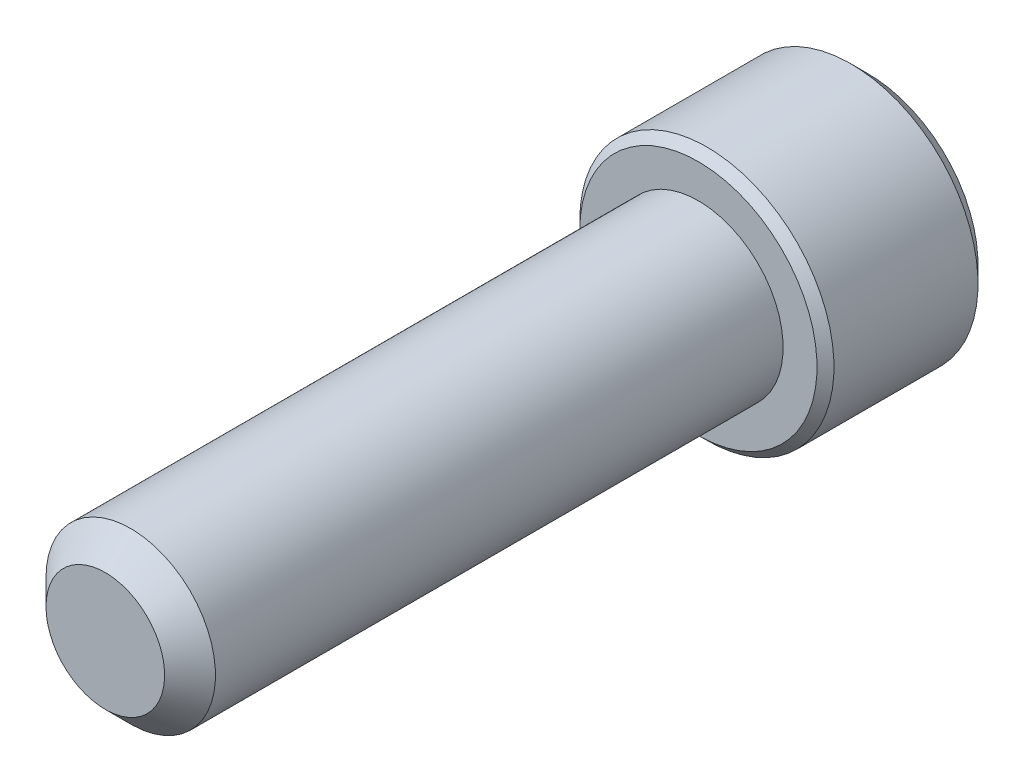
ISO-10303-21;
HEADER;
FILE_DESCRIPTION(('STEP AP214'),'2;1');
FILE_NAME('part.step','',(''),(''),'','','');
FILE_SCHEMA(('AUTOMOTIVE_DESIGN { 1 0 10303 214 1 1 1 1 }'));
ENDSEC;
DATA;
#1=APPLICATION_CONTEXT('core data for automotive mechanical design processes');
#2=APPLICATION_PROTOCOL_DEFINITION('international standard','automotive_design',2000,#1);
#3=PRODUCT_CONTEXT('',#1,'mechanical');
#4=PRODUCT('Part','Part','',(#3));
#5=PRODUCT_RELATED_PRODUCT_CATEGORY('part','',(#4));
#6=PRODUCT_DEFINITION_FORMATION('','',#4);
#7=PRODUCT_DEFINITION_CONTEXT('part definition',#1,'design');
#8=PRODUCT_DEFINITION('design','',#6,#7);
#9=PRODUCT_DEFINITION_SHAPE('','',#8);
#10=(LENGTH_UNIT() NAMED_UNIT(*) SI_UNIT(.MILLI.,.METRE.));
#11=(NAMED_UNIT(*) PLANE_ANGLE_UNIT() SI_UNIT($,.RADIAN.));
#12=(NAMED_UNIT(*) SI_UNIT($,.STERADIAN.) SOLID_ANGLE_UNIT());
#13=UNCERTAINTY_MEASURE_WITH_UNIT(LENGTH_MEASURE(1.E-05),#10,'distance_accuracy_value','');
#14=(GEOMETRIC_REPRESENTATION_CONTEXT(3) GLOBAL_UNCERTAINTY_ASSIGNED_CONTEXT((#13)) GLOBAL_UNIT_ASSIGNED_CONTEXT((#10,
#11,#12)) REPRESENTATION_CONTEXT('',''));
#15=CARTESIAN_POINT('',(0.,0.,0.));
#16=DIRECTION('',(0.,0.,1.));
#17=DIRECTION('',(1.,0.,0.));
#18=AXIS2_PLACEMENT_3D('',#15,#16,#17);
#19=CARTESIAN_POINT('',(0.,0.,-22.225));
#20=DIRECTION('',(0.,0.,1.));
#21=DIRECTION('',(1.,0.,0.));
#22=AXIS2_PLACEMENT_3D('',#19,#20,#21);
#23=CYLINDRICAL_SURFACE('',#22,3.175);
#24=CARTESIAN_POINT('',(0.,0.,-0.952500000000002));
#25=DIRECTION('',(0.,0.,1.));
#26=DIRECTION('',(1.,0.,0.));
#27=AXIS2_PLACEMENT_3D('',#24,#25,#26);
#28=CIRCLE('',#27,3.175);
#29=CARTESIAN_POINT('',(-3.175,0.,-0.952500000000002));
#30=VERTEX_POINT('',#29);
#31=EDGE_CURVE('E111',#30,#30,#28,.F.);
#32=ORIENTED_EDGE('',*,*,#31,.T.);
#33=EDGE_LOOP('',(#32));
#34=FACE_BOUND('',#33,.T.);
#35=CARTESIAN_POINT('',(0.,0.,-22.225));
#36=DIRECTION('',(0.,0.,-1.));
#37=DIRECTION('',(-1.,0.,0.));
#38=AXIS2_PLACEMENT_3D('',#35,#36,#37);
#39=CIRCLE('',#38,3.175);
#40=CARTESIAN_POINT('',(-3.175,0.,-22.225));
#41=VERTEX_POINT('',#40);
#42=EDGE_CURVE('E211',#41,#41,#39,.F.);
#43=ORIENTED_EDGE('',*,*,#42,.T.);
#44=EDGE_LOOP('',(#43));
#45=FACE_BOUND('',#44,.T.);
#46=ADVANCED_FACE('F37',(#34,#45),#23,.T.);
#47=CARTESIAN_POINT('',(0.,0.,0.));
#48=DIRECTION('',(0.,0.,1.));
#49=DIRECTION('',(1.,0.,0.));
#50=AXIS2_PLACEMENT_3D('',#47,#48,#49);
#51=PLANE('',#50);
#52=CARTESIAN_POINT('',(0.,0.,0.));
#53=DIRECTION('',(0.,0.,1.));
#54=DIRECTION('',(1.,0.,0.));
#55=AXIS2_PLACEMENT_3D('',#52,#53,#54);
#56=CIRCLE('',#55,2.2225);
#57=CARTESIAN_POINT('',(-2.2225,0.,0.));
#58=VERTEX_POINT('',#57);
#59=EDGE_CURVE('E210',#58,#58,#56,.T.);
#60=ORIENTED_EDGE('',*,*,#59,.T.);
#61=EDGE_LOOP('',(#60));
#62=FACE_BOUND('',#61,.T.);
#63=ADVANCED_FACE('F188',(#62),#51,.T.);
#64=CARTESIAN_POINT('',(0.,0.,0.));
#65=DIRECTION('',(0.,0.,-1.));
#66=DIRECTION('',(-1.,0.,0.));
#67=AXIS2_PLACEMENT_3D('',#64,#65,#66);
#68=CONICAL_SURFACE('',#67,2.2225,0.785398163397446);
#69=CARTESIAN_POINT('',(-3.175,0.,-0.952500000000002));
#70=CARTESIAN_POINT('',(-3.165078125,0.,-0.942578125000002));
#71=CARTESIAN_POINT('',(-3.15515625,0.,-0.932656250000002));
#72=CARTESIAN_POINT('',(-3.1353125,0.,-0.912812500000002));
#73=CARTESIAN_POINT('',(-3.125390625,0.,-0.902890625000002));
#74=CARTESIAN_POINT('',(-3.105546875,0.,-0.883046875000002));
#75=CARTESIAN_POINT('',(-3.095625,0.,-0.873125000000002));
#76=CARTESIAN_POINT('',(-3.07578125,0.,-0.853281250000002));
#77=CARTESIAN_POINT('',(-3.065859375,0.,-0.843359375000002));
#78=CARTESIAN_POINT('',(-3.046015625,0.,-0.823515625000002));
#79=CARTESIAN_POINT('',(-3.03609375,0.,-0.813593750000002));
#80=CARTESIAN_POINT('',(-3.01625,0.,-0.793750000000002));
#81=CARTESIAN_POINT('',(-3.006328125,0.,-0.783828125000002));
#82=CARTESIAN_POINT('',(-2.986484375,0.,-0.763984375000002));
#83=CARTESIAN_POINT('',(-2.9765625,0.,-0.754062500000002));
#84=CARTESIAN_POINT('',(-2.95671875,0.,-0.734218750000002));
#85=CARTESIAN_POINT('',(-2.946796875,0.,-0.724296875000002));
#86=CARTESIAN_POINT('',(-2.926953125,0.,-0.704453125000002));
#87=CARTESIAN_POINT('',(-2.91703125,0.,-0.694531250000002));
#88=CARTESIAN_POINT('',(-2.8971875,0.,-0.674687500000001));
#89=CARTESIAN_POINT('',(-2.887265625,0.,-0.664765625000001));
#90=CARTESIAN_POINT('',(-2.867421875,0.,-0.644921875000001));
#91=CARTESIAN_POINT('',(-2.8575,0.,-0.635000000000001));
#92=CARTESIAN_POINT('',(-2.83765625,0.,-0.615156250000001));
#93=CARTESIAN_POINT('',(-2.827734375,0.,-0.605234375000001));
#94=CARTESIAN_POINT('',(-2.807890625,0.,-0.585390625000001));
#95=CARTESIAN_POINT('',(-2.79796875,0.,-0.575468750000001));
#96=CARTESIAN_POINT('',(-2.778125,0.,-0.555625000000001));
#97=CARTESIAN_POINT('',(-2.768203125,0.,-0.545703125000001));
#98=CARTESIAN_POINT('',(-2.748359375,0.,-0.525859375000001));
#99=CARTESIAN_POINT('',(-2.7384375,0.,-0.515937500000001));
#100=CARTESIAN_POINT('',(-2.71859375,0.,-0.496093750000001));
#101=CARTESIAN_POINT('',(-2.708671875,0.,-0.486171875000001));
#102=CARTESIAN_POINT('',(-2.688828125,0.,-0.466328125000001));
#103=CARTESIAN_POINT('',(-2.67890625,0.,-0.456406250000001));
#104=CARTESIAN_POINT('',(-2.6590625,0.,-0.436562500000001));
#105=CARTESIAN_POINT('',(-2.649140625,0.,-0.426640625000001));
#106=CARTESIAN_POINT('',(-2.629296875,0.,-0.406796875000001));
#107=CARTESIAN_POINT('',(-2.619375,0.,-0.396875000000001));
#108=CARTESIAN_POINT('',(-2.59953125,0.,-0.377031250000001));
#109=CARTESIAN_POINT('',(-2.589609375,0.,-0.367109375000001));
#110=CARTESIAN_POINT('',(-2.569765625,0.,-0.347265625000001));
#111=CARTESIAN_POINT('',(-2.55984375,0.,-0.337343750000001));
#112=CARTESIAN_POINT('',(-2.54,0.,-0.317500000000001));
#113=CARTESIAN_POINT('',(-2.530078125,0.,-0.307578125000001));
#114=CARTESIAN_POINT('',(-2.510234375,0.,-0.287734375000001));
#115=CARTESIAN_POINT('',(-2.5003125,0.,-0.277812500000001));
#116=CARTESIAN_POINT('',(-2.48046875,0.,-0.257968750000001));
#117=CARTESIAN_POINT('',(-2.470546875,0.,-0.248046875));
#118=CARTESIAN_POINT('',(-2.450703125,0.,-0.228203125));
#119=CARTESIAN_POINT('',(-2.44078125,0.,-0.21828125));
#120=CARTESIAN_POINT('',(-2.4209375,0.,-0.1984375));
#121=CARTESIAN_POINT('',(-2.411015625,0.,-0.188515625));
#122=CARTESIAN_POINT('',(-2.391171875,0.,-0.168671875));
#123=CARTESIAN_POINT('',(-2.38125,0.,-0.15875));
#124=CARTESIAN_POINT('',(-2.36140625,0.,-0.13890625));
#125=CARTESIAN_POINT('',(-2.351484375,0.,-0.128984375));
#126=CARTESIAN_POINT('',(-2.331640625,0.,-0.109140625));
#127=CARTESIAN_POINT('',(-2.32171875,0.,-0.0992187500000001));
#128=CARTESIAN_POINT('',(-2.301875,0.,-0.0793750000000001));
#129=CARTESIAN_POINT('',(-2.291953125,0.,-0.0694531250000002));
#130=CARTESIAN_POINT('',(-2.272109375,0.,-0.0496093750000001));
#131=CARTESIAN_POINT('',(-2.2621875,0.,-0.0396875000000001));
#132=CARTESIAN_POINT('',(-2.24234375,0.,-0.01984375));
#133=CARTESIAN_POINT('',(-2.232421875,0.,-0.00992187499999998));
#134=CARTESIAN_POINT('',(-2.2225,0.,0.));
#135=B_SPLINE_CURVE_WITH_KNOTS('',3,(#69,#70,#71,#72,#73,#74,#75,#76,#77,#78,#79,#80,#81,#82,
#83,#84,#85,#86,#87,#88,#89,#90,#91,#92,#93,#94,#95,#96,#97,#98,#99,#100,#101,#102,#103,#104,
#105,#106,#107,#108,#109,#110,#111,#112,#113,#114,#115,#116,#117,#118,#119,#120,#121,#122,#123,
#124,#125,#126,#127,#128,#129,#130,#131,#132,#133,#134),.UNSPECIFIED.,.F.,.F.,(4,2,2,2,2,2,2,2,
2,2,2,2,2,2,2,2,2,2,2,2,2,2,2,2,2,2,2,2,2,2,2,2,4),(0.,0.0420949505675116,0.0841899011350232,
0.126284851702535,0.168379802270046,0.210474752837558,0.25256970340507,0.294664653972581,
0.336759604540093,0.378854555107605,0.420949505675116,0.463044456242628,0.50513940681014,
0.547234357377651,0.589329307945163,0.631424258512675,0.673519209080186,0.715614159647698,
0.75770911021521,0.799804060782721,0.841899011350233,0.883993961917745,0.926088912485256,
0.968183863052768,1.01027881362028,1.05237376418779,1.0944687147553,1.13656366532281,
1.17865861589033,1.22075356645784,1.26284851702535,1.30494346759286,1.34703841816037),.UNSPECIFIED.);
#136=EDGE_CURVE('BSEAM194',#30,#58,#135,.T.);
#137=ORIENTED_EDGE('',*,*,#31,.F.);
#138=ORIENTED_EDGE('',*,*,#59,.F.);
#139=ORIENTED_EDGE('',*,*,#136,.T.);
#140=ORIENTED_EDGE('',*,*,#136,.F.);
#141=EDGE_LOOP('',(#137,#139,#138,#140));
#142=FACE_BOUND('',#141,.T.);
#143=ADVANCED_FACE('F194',(#142),#68,.T.);
#144=CARTESIAN_POINT('',(0.,0.,-28.575));
#145=DIRECTION('',(0.,0.,1.));
#146=DIRECTION('',(1.,0.,0.));
#147=AXIS2_PLACEMENT_3D('',#144,#145,#146);
#148=CYLINDRICAL_SURFACE('',#147,4.7625);
#149=CARTESIAN_POINT('',(0.,0.,-22.5425));
#150=DIRECTION('',(0.,0.,-1.));
#151=DIRECTION('',(-1.,0.,0.));
#152=AXIS2_PLACEMENT_3D('',#149,#150,#151);
#153=CIRCLE('',#152,4.7625);
#154=CARTESIAN_POINT('',(-4.7625,0.,-22.5425));
#155=VERTEX_POINT('',#154);
#156=EDGE_CURVE('E45',#155,#155,#153,.T.);
#157=ORIENTED_EDGE('',*,*,#156,.T.);
#158=EDGE_LOOP('',(#157));
#159=FACE_BOUND('',#158,.T.);
#160=CARTESIAN_POINT('',(0.,0.,-27.94));
#161=DIRECTION('',(0.,0.,-1.));
#162=DIRECTION('',(-1.,0.,0.));
#163=AXIS2_PLACEMENT_3D('',#160,#161,#162);
#164=CIRCLE('',#163,4.7625);
#165=CARTESIAN_POINT('',(-4.7625,0.,-27.94));
#166=VERTEX_POINT('',#165);
#167=EDGE_CURVE('E171',#166,#166,#164,.F.);
#168=ORIENTED_EDGE('',*,*,#167,.T.);
#169=EDGE_LOOP('',(#168));
#170=FACE_BOUND('',#169,.T.);
#171=ADVANCED_FACE('F176',(#159,#170),#148,.T.);
#172=CARTESIAN_POINT('',(0.,0.,-28.575));
#173=DIRECTION('',(0.,0.,-1.));
#174=DIRECTION('',(-1.,0.,0.));
#175=AXIS2_PLACEMENT_3D('',#172,#173,#174);
#176=PLANE('',#175);
#177=CARTESIAN_POINT('',(0.,0.,-28.575));
#178=DIRECTION('',(0.,0.,-1.));
#179=DIRECTION('',(-1.,0.,0.));
#180=AXIS2_PLACEMENT_3D('',#177,#178,#179);
#181=CIRCLE('',#180,4.1275);
#182=CARTESIAN_POINT('',(-4.1275,0.,-28.575));
#183=VERTEX_POINT('',#182);
#184=EDGE_CURVE('E110',#183,#183,#181,.T.);
#185=ORIENTED_EDGE('',*,*,#184,.T.);
#186=EDGE_LOOP('',(#185));
#187=FACE_BOUND('',#186,.T.);
#188=CARTESIAN_POINT('',(0.,0.,-28.575));
#189=DIRECTION('',(0.,0.,-1.));
#190=DIRECTION('',(-1.,0.,0.));
#191=AXIS2_PLACEMENT_3D('',#188,#189,#190);
#192=CIRCLE('',#191,2.74963065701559);
#193=CARTESIAN_POINT('',(-2.38125,1.3748153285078,-28.575));
#194=VERTEX_POINT('',#193);
#195=CARTESIAN_POINT('',(0.,2.74963065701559,-28.575));
#196=VERTEX_POINT('',#195);
#197=EDGE_CURVE('E91',#194,#196,#192,.T.);
#198=ORIENTED_EDGE('',*,*,#197,.F.);
#199=CARTESIAN_POINT('',(-2.38125,-1.3748153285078,-28.575));
#200=VERTEX_POINT('',#199);
#201=EDGE_CURVE('E51',#200,#194,#192,.T.);
#202=ORIENTED_EDGE('',*,*,#201,.F.);
#203=CARTESIAN_POINT('',(0.,-2.74963065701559,-28.575));
#204=VERTEX_POINT('',#203);
#205=EDGE_CURVE('E267',#204,#200,#192,.T.);
#206=ORIENTED_EDGE('',*,*,#205,.F.);
#207=CARTESIAN_POINT('',(2.38125,-1.3748153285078,-28.575));
#208=VERTEX_POINT('',#207);
#209=EDGE_CURVE('E58',#208,#204,#192,.T.);
#210=ORIENTED_EDGE('',*,*,#209,.F.);
#211=CARTESIAN_POINT('',(2.38125,1.3748153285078,-28.575));
#212=VERTEX_POINT('',#211);
#213=EDGE_CURVE('E132',#212,#208,#192,.T.);
#214=ORIENTED_EDGE('',*,*,#213,.F.);
#215=EDGE_CURVE('E100',#196,#212,#192,.T.);
#216=ORIENTED_EDGE('',*,*,#215,.F.);
#217=EDGE_LOOP('',(#198,#202,#206,#210,#214,#216));
#218=FACE_BOUND('',#217,.T.);
#219=ADVANCED_FACE('F131',(#187,#218),#176,.T.);
#220=CARTESIAN_POINT('',(0.,0.,-22.225));
#221=DIRECTION('',(0.,0.,-1.));
#222=DIRECTION('',(-1.,0.,0.));
#223=AXIS2_PLACEMENT_3D('',#220,#221,#222);
#224=PLANE('',#223);
#225=CARTESIAN_POINT('',(0.,0.,-22.225));
#226=DIRECTION('',(0.,0.,-1.));
#227=DIRECTION('',(-1.,0.,0.));
#228=AXIS2_PLACEMENT_3D('',#225,#226,#227);
#229=CIRCLE('',#228,4.445);
#230=CARTESIAN_POINT('',(-4.445,0.,-22.225));
#231=VERTEX_POINT('',#230);
#232=EDGE_CURVE('E12',#231,#231,#229,.F.);
#233=ORIENTED_EDGE('',*,*,#232,.T.);
#234=EDGE_LOOP('',(#233));
#235=FACE_BOUND('',#234,.T.);
#236=ORIENTED_EDGE('',*,*,#42,.F.);
#237=EDGE_LOOP('',(#236));
#238=FACE_BOUND('',#237,.T.);
#239=ADVANCED_FACE('F279',(#235,#238),#224,.F.);
#240=CARTESIAN_POINT('',(0.,0.,-28.575));
#241=DIRECTION('',(0.,0.,-1.));
#242=DIRECTION('',(-1.,0.,0.));
#243=AXIS2_PLACEMENT_3D('',#240,#241,#242);
#244=CONICAL_SURFACE('',#243,2.74963065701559,0.78539816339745);
#245=ORIENTED_EDGE('',*,*,#215,.T.);
#246=CARTESIAN_POINT('',(-0.000199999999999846,2.74974612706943,-28.5751154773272));
#247=CARTESIAN_POINT('',(0.0816567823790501,2.70248609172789,-28.5278948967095));
#248=CARTESIAN_POINT('',(0.16488233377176,2.65443579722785,-28.4834475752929));
#249=CARTESIAN_POINT('',(0.334588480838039,2.556455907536,-28.4020654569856));
#250=CARTESIAN_POINT('',(0.421085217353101,2.50651699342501,-28.3651759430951));
#251=CARTESIAN_POINT('',(0.59550177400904,2.40581754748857,-28.3019834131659));
#252=CARTESIAN_POINT('',(0.683377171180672,2.35508266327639,-28.2755215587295));
#253=CARTESIAN_POINT('',(0.861062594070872,2.25249593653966,-28.2347515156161));
#254=CARTESIAN_POINT('',(0.950867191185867,2.20064722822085,-28.2204128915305));
#255=CARTESIAN_POINT('',(1.10563960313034,2.11128933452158,-28.2074757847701));
#256=CARTESIAN_POINT('',(1.17040744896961,2.07389560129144,-28.2055606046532));
#257=CARTESIAN_POINT('',(1.29983727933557,1.99916925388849,-28.2087866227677));
#258=CARTESIAN_POINT('',(1.36449921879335,1.96183666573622,-28.2139302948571));
#259=CARTESIAN_POINT('',(1.49321254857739,1.88752399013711,-28.2309813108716));
#260=CARTESIAN_POINT('',(1.55726317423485,1.85054434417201,-28.2428962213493));
#261=CARTESIAN_POINT('',(1.68425683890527,1.77722451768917,-28.272835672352));
#262=CARTESIAN_POINT('',(1.74719996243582,1.74088428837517,-28.2908597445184));
#263=CARTESIAN_POINT('',(1.90842615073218,1.64780030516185,-28.3443688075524));
#264=CARTESIAN_POINT('',(2.00570949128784,1.59163374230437,-28.3838874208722));
#265=CARTESIAN_POINT('',(2.14875606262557,1.50904576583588,-28.4506003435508));
#266=CARTESIAN_POINT('',(2.19589628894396,1.4818293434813,-28.4740402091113));
#267=CARTESIAN_POINT('',(2.28930352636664,1.42790064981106,-28.5230566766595));
#268=CARTESIAN_POINT('',(2.33557105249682,1.40118808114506,-28.5486319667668));
#269=CARTESIAN_POINT('',(2.38145,1.37469985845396,-28.5751154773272));
#270=B_SPLINE_CURVE_WITH_KNOTS('',3,(#246,#247,#248,#249,#250,#251,#252,#253,#254,#255,#256,
#257,#258,#259,#260,#261,#262,#263,#264,#265,#266,#267,#268,#269),.UNSPECIFIED.,.F.,.F.,(4,2,2,
2,2,2,2,2,2,2,2,4),(0.,0.317196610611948,0.636241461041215,0.950218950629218,1.26340583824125,
1.48752413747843,1.71172100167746,1.93616888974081,2.16059957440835,2.51709639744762,
2.69486147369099,2.87251813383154),.UNSPECIFIED.);
#271=EDGE_CURVE('E105',#196,#212,#270,.T.);
#272=ORIENTED_EDGE('',*,*,#271,.F.);
#273=EDGE_LOOP('',(#245,#272));
#274=FACE_BOUND('',#273,.T.);
#275=ADVANCED_FACE('F106',(#274),#244,.F.);
#276=ORIENTED_EDGE('',*,*,#213,.T.);
#277=CARTESIAN_POINT('',(2.38125,-2.76261914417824,-29.4726170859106));
#278=CARTESIAN_POINT('',(2.38125,-2.69544479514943,-29.4217472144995));
#279=CARTESIAN_POINT('',(2.38125,-2.62789666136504,-29.371362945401));
#280=CARTESIAN_POINT('',(2.38125,-2.49190448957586,-29.2717837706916));
#281=CARTESIAN_POINT('',(2.38125,-2.42346023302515,-29.2225891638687));
#282=CARTESIAN_POINT('',(2.38125,-2.28502676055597,-29.1252575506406));
#283=CARTESIAN_POINT('',(2.38125,-2.21502968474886,-29.0771316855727));
#284=CARTESIAN_POINT('',(2.38125,-2.07385103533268,-28.9826556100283));
#285=CARTESIAN_POINT('',(2.38125,-2.00266954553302,-28.936305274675));
#286=CARTESIAN_POINT('',(2.38125,-1.85474026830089,-28.8431368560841));
#287=CARTESIAN_POINT('',(2.38125,-1.7779099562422,-28.7964491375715));
#288=CARTESIAN_POINT('',(2.38125,-1.62247617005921,-28.7061296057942));
#289=CARTESIAN_POINT('',(2.38125,-1.5438729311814,-28.6624973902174));
#290=CARTESIAN_POINT('',(2.38125,-1.38486272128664,-28.5792071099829));
#291=CARTESIAN_POINT('',(2.38125,-1.30446163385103,-28.5395379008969));
#292=CARTESIAN_POINT('',(2.38125,-1.14145314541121,-28.4650690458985));
#293=CARTESIAN_POINT('',(2.38125,-1.05884677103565,-28.4302671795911));
#294=CARTESIAN_POINT('',(2.38125,-0.89829608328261,-28.3694298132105));
#295=CARTESIAN_POINT('',(2.38125,-0.820539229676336,-28.3429047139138));
#296=CARTESIAN_POINT('',(2.38125,-0.663135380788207,-28.29608983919));
#297=CARTESIAN_POINT('',(2.38125,-0.583488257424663,-28.2758004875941));
#298=CARTESIAN_POINT('',(2.38125,-0.424114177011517,-28.2428604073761));
#299=CARTESIAN_POINT('',(2.38125,-0.344414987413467,-28.2300775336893));
#300=CARTESIAN_POINT('',(2.38125,-0.184141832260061,-28.2124018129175));
#301=CARTESIAN_POINT('',(2.38125,-0.103568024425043,-28.2075075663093));
#302=CARTESIAN_POINT('',(2.38125,0.0546452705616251,-28.2059814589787));
#303=CARTESIAN_POINT('',(2.38125,0.132281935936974,-28.2090477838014));
#304=CARTESIAN_POINT('',(2.38125,0.286899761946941,-28.2226029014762));
#305=CARTESIAN_POINT('',(2.38125,0.363880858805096,-28.2330924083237));
#306=CARTESIAN_POINT('',(2.38125,0.517934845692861,-28.2610957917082));
#307=CARTESIAN_POINT('',(2.38125,0.594985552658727,-28.2787299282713));
#308=CARTESIAN_POINT('',(2.38125,0.747397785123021,-28.3200790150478));
#309=CARTESIAN_POINT('',(2.38125,0.822759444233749,-28.3437934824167));
#310=CARTESIAN_POINT('',(2.38125,1.05910849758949,-28.4271079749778));
#311=CARTESIAN_POINT('',(2.38125,1.21677702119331,-28.4961581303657));
#312=CARTESIAN_POINT('',(2.38125,1.44750538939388,-28.6112600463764));
#313=CARTESIAN_POINT('',(2.38125,1.52359597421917,-28.6516390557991));
#314=CARTESIAN_POINT('',(2.38125,1.67404919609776,-28.7355045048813));
#315=CARTESIAN_POINT('',(2.38125,1.74841214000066,-28.7789903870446));
#316=CARTESIAN_POINT('',(2.38125,1.89195740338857,-28.8662197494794));
#317=CARTESIAN_POINT('',(2.38125,1.96121356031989,-28.9098431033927));
#318=CARTESIAN_POINT('',(2.38125,2.09853826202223,-28.9989297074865));
#319=CARTESIAN_POINT('',(2.38125,2.1666067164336,-29.0443930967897));
#320=CARTESIAN_POINT('',(2.38125,2.30115854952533,-29.1364552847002));
#321=CARTESIAN_POINT('',(2.38125,2.36765030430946,-29.1830418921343));
#322=CARTESIAN_POINT('',(2.38125,2.4997244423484,-29.2774503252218));
#323=CARTESIAN_POINT('',(2.38125,2.56530707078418,-29.3252718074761));
#324=CARTESIAN_POINT('',(2.38125,2.63050907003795,-29.3735984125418));
#325=B_SPLINE_CURVE_WITH_KNOTS('',3,(#277,#278,#279,#280,#281,#282,#283,#284,#285,#286,#287,
#288,#289,#290,#291,#292,#293,#294,#295,#296,#297,#298,#299,#300,#301,#302,#303,#304,#305,#306,
#307,#308,#309,#310,#311,#312,#313,#314,#315,#316,#317,#318,#319,#320,#321,#322,#323,#324),
.UNSPECIFIED.,.F.,.F.,(4,2,2,2,2,2,2,2,2,2,2,2,2,2,2,2,2,2,2,2,2,2,2,4),(0.,0.252791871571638,
0.505646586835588,0.760459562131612,1.01525458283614,1.28490904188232,1.55452792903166,
1.82336591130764,2.09208085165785,2.33833488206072,2.58460564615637,2.82639989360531,
3.06815123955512,3.30087188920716,3.53361492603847,3.7704500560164,4.00726638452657,
4.52203846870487,4.78044014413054,5.03879556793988,5.28431582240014,5.52985467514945,
5.77340315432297,6.01688462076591),.UNSPECIFIED.);
#326=EDGE_CURVE('E99',#212,#208,#325,.F.);
#327=ORIENTED_EDGE('',*,*,#326,.F.);
#328=EDGE_LOOP('',(#276,#327));
#329=FACE_BOUND('',#328,.T.);
#330=ADVANCED_FACE('F273',(#329),#244,.F.);
#331=ORIENTED_EDGE('',*,*,#209,.T.);
#332=CARTESIAN_POINT('',(2.38145,-1.37469985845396,-28.5751154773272));
#333=CARTESIAN_POINT('',(2.29959321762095,-1.4219598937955,-28.5278948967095));
#334=CARTESIAN_POINT('',(2.21636766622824,-1.47001018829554,-28.4834475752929));
#335=CARTESIAN_POINT('',(2.04666151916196,-1.56799007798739,-28.4020654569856));
#336=CARTESIAN_POINT('',(1.9601647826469,-1.61792899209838,-28.3651759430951));
#337=CARTESIAN_POINT('',(1.78574822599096,-1.71862843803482,-28.3019834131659));
#338=CARTESIAN_POINT('',(1.69787282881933,-1.769363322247,-28.2755215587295));
#339=CARTESIAN_POINT('',(1.52018740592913,-1.87195004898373,-28.2347515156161));
#340=CARTESIAN_POINT('',(1.43038280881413,-1.92379875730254,-28.2204128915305));
#341=CARTESIAN_POINT('',(1.27561039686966,-2.01315665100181,-28.2074757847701));
#342=CARTESIAN_POINT('',(1.21084255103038,-2.05055038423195,-28.2055606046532));
#343=CARTESIAN_POINT('',(1.08141272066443,-2.1252767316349,-28.2087866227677));
#344=CARTESIAN_POINT('',(1.01675078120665,-2.16260931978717,-28.2139302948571));
#345=CARTESIAN_POINT('',(0.888037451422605,-2.23692199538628,-28.2309813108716));
#346=CARTESIAN_POINT('',(0.823986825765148,-2.27390164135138,-28.2428962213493));
#347=CARTESIAN_POINT('',(0.696993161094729,-2.34722146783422,-28.272835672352));
#348=CARTESIAN_POINT('',(0.634050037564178,-2.38356169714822,-28.2908597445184));
#349=CARTESIAN_POINT('',(0.472823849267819,-2.47664568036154,-28.3443688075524));
#350=CARTESIAN_POINT('',(0.37554050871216,-2.53281224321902,-28.3838874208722));
#351=CARTESIAN_POINT('',(0.23249393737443,-2.61540021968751,-28.4506003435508));
#352=CARTESIAN_POINT('',(0.185353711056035,-2.6426166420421,-28.4740402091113));
#353=CARTESIAN_POINT('',(0.091946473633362,-2.69654533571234,-28.5230566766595));
#354=CARTESIAN_POINT('',(0.0456789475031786,-2.72325790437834,-28.5486319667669));
#355=CARTESIAN_POINT('',(-0.000200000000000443,-2.74974612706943,-28.5751154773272));
#356=B_SPLINE_CURVE_WITH_KNOTS('',3,(#332,#333,#334,#335,#336,#337,#338,#339,#340,#341,#342,
#343,#344,#345,#346,#347,#348,#349,#350,#351,#352,#353,#354,#355),.UNSPECIFIED.,.F.,.F.,(4,2,2,
2,2,2,2,2,2,2,2,4),(0.,0.31719661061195,0.636241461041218,0.950218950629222,1.26340583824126,
1.48752413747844,1.71172100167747,1.93616888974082,2.16059957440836,2.51709639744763,
2.69486147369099,2.87251813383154),.UNSPECIFIED.);
#357=EDGE_CURVE('E141',#208,#204,#356,.T.);
#358=ORIENTED_EDGE('',*,*,#357,.F.);
#359=EDGE_LOOP('',(#331,#358));
#360=FACE_BOUND('',#359,.T.);
#361=ADVANCED_FACE('F270',(#360),#244,.F.);
#362=ORIENTED_EDGE('',*,*,#205,.T.);
#363=CARTESIAN_POINT('',(0.000200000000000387,-2.74974612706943,-28.5751154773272));
#364=CARTESIAN_POINT('',(-0.0816567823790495,-2.70248609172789,-28.5278948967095));
#365=CARTESIAN_POINT('',(-0.16488233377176,-2.65443579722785,-28.4834475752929));
#366=CARTESIAN_POINT('',(-0.33458848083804,-2.556455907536,-28.4020654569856));
#367=CARTESIAN_POINT('',(-0.421085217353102,-2.50651699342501,-28.3651759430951));
#368=CARTESIAN_POINT('',(-0.595501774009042,-2.40581754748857,-28.3019834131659));
#369=CARTESIAN_POINT('',(-0.683377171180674,-2.35508266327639,-28.2755215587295));
#370=CARTESIAN_POINT('',(-0.861062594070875,-2.25249593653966,-28.2347515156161));
#371=CARTESIAN_POINT('',(-0.950867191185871,-2.20064722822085,-28.2204128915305));
#372=CARTESIAN_POINT('',(-1.10563960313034,-2.11128933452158,-28.2074757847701));
#373=CARTESIAN_POINT('',(-1.17040744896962,-2.07389560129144,-28.2055606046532));
#374=CARTESIAN_POINT('',(-1.29983727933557,-1.99916925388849,-28.2087866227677));
#375=CARTESIAN_POINT('',(-1.36449921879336,-1.96183666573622,-28.2139302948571));
#376=CARTESIAN_POINT('',(-1.4932125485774,-1.88752399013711,-28.2309813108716));
#377=CARTESIAN_POINT('',(-1.55726317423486,-1.85054434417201,-28.2428962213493));
#378=CARTESIAN_POINT('',(-1.68425683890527,-1.77722451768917,-28.272835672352));
#379=CARTESIAN_POINT('',(-1.74719996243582,-1.74088428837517,-28.2908597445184));
#380=CARTESIAN_POINT('',(-1.90842615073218,-1.64780030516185,-28.3443688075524));
#381=CARTESIAN_POINT('',(-2.00570949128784,-1.59163374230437,-28.3838874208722));
#382=CARTESIAN_POINT('',(-2.14875606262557,-1.50904576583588,-28.4506003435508));
#383=CARTESIAN_POINT('',(-2.19589628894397,-1.48182934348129,-28.4740402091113));
#384=CARTESIAN_POINT('',(-2.28930352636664,-1.42790064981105,-28.5230566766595));
#385=CARTESIAN_POINT('',(-2.33557105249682,-1.40118808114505,-28.5486319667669));
#386=CARTESIAN_POINT('',(-2.38145,-1.37469985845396,-28.5751154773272));
#387=B_SPLINE_CURVE_WITH_KNOTS('',3,(#363,#364,#365,#366,#367,#368,#369,#370,#371,#372,#373,
#374,#375,#376,#377,#378,#379,#380,#381,#382,#383,#384,#385,#386),.UNSPECIFIED.,.F.,.F.,(4,2,2,
2,2,2,2,2,2,2,2,4),(0.,0.317196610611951,0.636241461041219,0.950218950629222,1.26340583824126,
1.48752413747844,1.71172100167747,1.93616888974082,2.16059957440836,2.51709639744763,
2.69486147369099,2.87251813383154),.UNSPECIFIED.);
#388=EDGE_CURVE('E245',#204,#200,#387,.T.);
#389=ORIENTED_EDGE('',*,*,#388,.F.);
#390=EDGE_LOOP('',(#362,#389));
#391=FACE_BOUND('',#390,.T.);
#392=ADVANCED_FACE('F269',(#391),#244,.F.);
#393=ORIENTED_EDGE('',*,*,#201,.T.);
#394=CARTESIAN_POINT('',(-2.38125,-2.76261914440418,-29.4726170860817));
#395=CARTESIAN_POINT('',(-2.38125,-2.69544479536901,-29.4217472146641));
#396=CARTESIAN_POINT('',(-2.38125,-2.62789666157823,-29.3713629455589));
#397=CARTESIAN_POINT('',(-2.38125,-2.4919044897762,-29.2717837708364));
#398=CARTESIAN_POINT('',(-2.38125,-2.42346023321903,-29.2225891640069));
#399=CARTESIAN_POINT('',(-2.38125,-2.28502676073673,-29.1252575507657));
#400=CARTESIAN_POINT('',(-2.38125,-2.21502968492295,-29.0771316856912));
#401=CARTESIAN_POINT('',(-2.38125,-2.0738510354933,-28.9826556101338));
#402=CARTESIAN_POINT('',(-2.38125,-2.00266954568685,-28.9363052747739));
#403=CARTESIAN_POINT('',(-2.38125,-1.85474026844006,-28.8431368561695));
#404=CARTESIAN_POINT('',(-2.38125,-1.77790995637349,-28.7964491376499));
#405=CARTESIAN_POINT('',(-2.38125,-1.62247617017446,-28.706129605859));
#406=CARTESIAN_POINT('',(-2.38125,-1.54387293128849,-28.6624973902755));
#407=CARTESIAN_POINT('',(-2.38125,-1.38486272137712,-28.5792071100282));
#408=CARTESIAN_POINT('',(-2.38125,-1.30446163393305,-28.5395379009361));
#409=CARTESIAN_POINT('',(-2.38125,-1.14145314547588,-28.4650690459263));
#410=CARTESIAN_POINT('',(-2.38125,-1.05884677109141,-28.4302671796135));
#411=CARTESIAN_POINT('',(-2.38125,-0.898296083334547,-28.369429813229));
#412=CARTESIAN_POINT('',(-2.38125,-0.820539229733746,-28.3429047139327));
#413=CARTESIAN_POINT('',(-2.38125,-0.663135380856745,-28.2960898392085));
#414=CARTESIAN_POINT('',(-2.38125,-0.583488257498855,-28.2758004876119));
#415=CARTESIAN_POINT('',(-2.38125,-0.424114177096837,-28.2428604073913));
#416=CARTESIAN_POINT('',(-2.38125,-0.344414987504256,-28.2300775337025));
#417=CARTESIAN_POINT('',(-2.38125,-0.184141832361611,-28.2124018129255));
#418=CARTESIAN_POINT('',(-2.38125,-0.103568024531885,-28.2075075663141));
#419=CARTESIAN_POINT('',(-2.38125,0.0546452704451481,-28.2059814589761));
#420=CARTESIAN_POINT('',(-2.38125,0.132281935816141,-28.2090477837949));
#421=CARTESIAN_POINT('',(-2.38125,0.286899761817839,-28.2226029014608));
#422=CARTESIAN_POINT('',(-2.38125,0.363880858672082,-28.2330924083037));
#423=CARTESIAN_POINT('',(-2.38125,0.517934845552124,-28.2610957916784));
#424=CARTESIAN_POINT('',(-2.38125,0.594985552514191,-28.2787299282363));
#425=CARTESIAN_POINT('',(-2.38125,0.747397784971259,-28.3200790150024));
#426=CARTESIAN_POINT('',(-2.38125,0.82275944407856,-28.3437934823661));
#427=CARTESIAN_POINT('',(-2.38125,1.05910849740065,-28.4271079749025));
#428=CARTESIAN_POINT('',(-2.38125,1.21677702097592,-28.4961581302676));
#429=CARTESIAN_POINT('',(-2.38125,1.44750538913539,-28.6112600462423));
#430=CARTESIAN_POINT('',(-2.38125,1.52359597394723,-28.6516390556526));
#431=CARTESIAN_POINT('',(-2.38125,1.67404919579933,-28.7355045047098));
#432=CARTESIAN_POINT('',(-2.38125,1.7484121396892,-28.7789903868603));
#433=CARTESIAN_POINT('',(-2.38125,1.89195740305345,-28.866219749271));
#434=CARTESIAN_POINT('',(-2.38125,1.96121355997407,-28.9098431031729));
#435=CARTESIAN_POINT('',(-2.38125,2.09853826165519,-28.9989297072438));
#436=CARTESIAN_POINT('',(-2.38125,2.16660671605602,-29.0443930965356));
#437=CARTESIAN_POINT('',(-2.38125,2.30115854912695,-29.1364552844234));
#438=CARTESIAN_POINT('',(-2.38125,2.36765030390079,-29.1830418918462));
#439=CARTESIAN_POINT('',(-2.38125,2.49972444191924,-29.2774503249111));
#440=CARTESIAN_POINT('',(-2.38125,2.5653070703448,-29.3252718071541));
#441=CARTESIAN_POINT('',(-2.38125,2.63050906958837,-29.3735984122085));
#442=B_SPLINE_CURVE_WITH_KNOTS('',3,(#394,#395,#396,#397,#398,#399,#400,#401,#402,#403,#404,
#405,#406,#407,#408,#409,#410,#411,#412,#413,#414,#415,#416,#417,#418,#419,#420,#421,#422,#423,
#424,#425,#426,#427,#428,#429,#430,#431,#432,#433,#434,#435,#436,#437,#438,#439,#440,#441),
.UNSPECIFIED.,.F.,.F.,(4,2,2,2,2,2,2,2,2,2,2,2,2,2,2,2,2,2,2,2,2,2,2,4),(0.,0.252791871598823,
0.505646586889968,0.760459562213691,1.01525458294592,1.2849090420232,1.55452792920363,
1.82336591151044,2.09208085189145,2.33833488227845,2.58460564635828,2.82639989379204,
3.06815123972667,3.30087188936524,3.53361492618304,3.77045005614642,4.00726638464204,
4.52203846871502,4.78044014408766,5.03879556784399,5.28431582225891,5.52985467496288,
5.77340315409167,6.01688462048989),.UNSPECIFIED.);
#443=EDGE_CURVE('E121',#200,#194,#442,.T.);
#444=ORIENTED_EDGE('',*,*,#443,.F.);
#445=EDGE_LOOP('',(#393,#444));
#446=FACE_BOUND('',#445,.T.);
#447=ADVANCED_FACE('F286',(#446),#244,.F.);
#448=ORIENTED_EDGE('',*,*,#197,.T.);
#449=CARTESIAN_POINT('',(-2.38145,1.37469985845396,-28.5751154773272));
#450=CARTESIAN_POINT('',(-2.29959321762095,1.4219598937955,-28.5278948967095));
#451=CARTESIAN_POINT('',(-2.21636766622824,1.47001018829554,-28.4834475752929));
#452=CARTESIAN_POINT('',(-2.04666151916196,1.56799007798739,-28.4020654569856));
#453=CARTESIAN_POINT('',(-1.9601647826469,1.61792899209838,-28.3651759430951));
#454=CARTESIAN_POINT('',(-1.78574822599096,1.71862843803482,-28.3019834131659));
#455=CARTESIAN_POINT('',(-1.69787282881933,1.769363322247,-28.2755215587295));
#456=CARTESIAN_POINT('',(-1.52018740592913,1.87195004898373,-28.2347515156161));
#457=CARTESIAN_POINT('',(-1.43038280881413,1.92379875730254,-28.2204128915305));
#458=CARTESIAN_POINT('',(-1.27561039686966,2.01315665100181,-28.2074757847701));
#459=CARTESIAN_POINT('',(-1.21084255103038,2.05055038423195,-28.2055606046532));
#460=CARTESIAN_POINT('',(-1.08141272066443,2.1252767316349,-28.2087866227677));
#461=CARTESIAN_POINT('',(-1.01675078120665,2.16260931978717,-28.2139302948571));
#462=CARTESIAN_POINT('',(-0.888037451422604,2.23692199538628,-28.2309813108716));
#463=CARTESIAN_POINT('',(-0.823986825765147,2.27390164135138,-28.2428962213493));
#464=CARTESIAN_POINT('',(-0.696993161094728,2.34722146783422,-28.272835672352));
#465=CARTESIAN_POINT('',(-0.634050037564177,2.38356169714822,-28.2908597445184));
#466=CARTESIAN_POINT('',(-0.472823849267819,2.47664568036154,-28.3443688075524));
#467=CARTESIAN_POINT('',(-0.375540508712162,2.53281224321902,-28.3838874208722));
#468=CARTESIAN_POINT('',(-0.232493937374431,2.61540021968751,-28.4506003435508));
#469=CARTESIAN_POINT('',(-0.185353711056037,2.64261664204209,-28.4740402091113));
#470=CARTESIAN_POINT('',(-0.0919464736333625,2.69654533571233,-28.5230566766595));
#471=CARTESIAN_POINT('',(-0.0456789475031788,2.72325790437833,-28.5486319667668));
#472=CARTESIAN_POINT('',(0.000199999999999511,2.74974612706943,-28.5751154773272));
#473=B_SPLINE_CURVE_WITH_KNOTS('',3,(#449,#450,#451,#452,#453,#454,#455,#456,#457,#458,#459,
#460,#461,#462,#463,#464,#465,#466,#467,#468,#469,#470,#471,#472),.UNSPECIFIED.,.F.,.F.,(4,2,2,
2,2,2,2,2,2,2,2,4),(0.,0.317196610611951,0.636241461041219,0.950218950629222,1.26340583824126,
1.48752413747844,1.71172100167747,1.93616888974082,2.16059957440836,2.51709639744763,
2.69486147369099,2.87251813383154),.UNSPECIFIED.);
#474=EDGE_CURVE('E95',#194,#196,#473,.T.);
#475=ORIENTED_EDGE('',*,*,#474,.F.);
#476=EDGE_LOOP('',(#448,#475));
#477=FACE_BOUND('',#476,.T.);
#478=ADVANCED_FACE('F93',(#477),#244,.F.);
#479=CARTESIAN_POINT('',(2.38125,4.12444598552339,-25.003125));
#480=DIRECTION('',(0.,0.,-1.));
#481=DIRECTION('',(-1.,0.,0.));
#482=AXIS2_PLACEMENT_3D('',#479,#480,#481);
#483=PLANE('',#482);
#484=DIRECTION('',(0.866025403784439,0.5,0.));
#485=VECTOR('',#484,1.);
#486=CARTESIAN_POINT('',(-2.38125,1.3748153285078,-25.003125));
#487=LINE('',#486,#485);
#488=CARTESIAN_POINT('',(-2.38125,1.3748153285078,-25.003125));
#489=VERTEX_POINT('',#488);
#490=CARTESIAN_POINT('',(0.,2.74963065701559,-25.003125));
#491=VERTEX_POINT('',#490);
#492=EDGE_CURVE('E120',#489,#491,#487,.T.);
#493=ORIENTED_EDGE('',*,*,#492,.T.);
#494=DIRECTION('',(0.866025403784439,-0.5,0.));
#495=VECTOR('',#494,1.);
#496=CARTESIAN_POINT('',(0.,2.74963065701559,-25.003125));
#497=LINE('',#496,#495);
#498=CARTESIAN_POINT('',(2.38125,1.3748153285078,-25.003125));
#499=VERTEX_POINT('',#498);
#500=EDGE_CURVE('E125',#491,#499,#497,.T.);
#501=ORIENTED_EDGE('',*,*,#500,.T.);
#502=DIRECTION('',(0.,-1.,0.));
#503=VECTOR('',#502,1.);
#504=CARTESIAN_POINT('',(2.38125,1.3748153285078,-25.003125));
#505=LINE('',#504,#503);
#506=CARTESIAN_POINT('',(2.38125,-1.3748153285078,-25.003125));
#507=VERTEX_POINT('',#506);
#508=EDGE_CURVE('E233',#499,#507,#505,.T.);
#509=ORIENTED_EDGE('',*,*,#508,.T.);
#510=DIRECTION('',(-0.866025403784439,-0.5,0.));
#511=VECTOR('',#510,1.);
#512=CARTESIAN_POINT('',(2.38125,-1.3748153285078,-25.003125));
#513=LINE('',#512,#511);
#514=CARTESIAN_POINT('',(0.,-2.74963065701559,-25.003125));
#515=VERTEX_POINT('',#514);
#516=EDGE_CURVE('E230',#507,#515,#513,.T.);
#517=ORIENTED_EDGE('',*,*,#516,.T.);
#518=DIRECTION('',(-0.866025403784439,0.5,0.));
#519=VECTOR('',#518,1.);
#520=CARTESIAN_POINT('',(0.,-2.74963065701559,-25.003125));
#521=LINE('',#520,#519);
#522=CARTESIAN_POINT('',(-2.38125,-1.3748153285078,-25.003125));
#523=VERTEX_POINT('',#522);
#524=EDGE_CURVE('E227',#515,#523,#521,.T.);
#525=ORIENTED_EDGE('',*,*,#524,.T.);
#526=DIRECTION('',(0.,1.,0.));
#527=VECTOR('',#526,1.);
#528=CARTESIAN_POINT('',(-2.38125,-1.3748153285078,-25.003125));
#529=LINE('',#528,#527);
#530=EDGE_CURVE('E128',#523,#489,#529,.T.);
#531=ORIENTED_EDGE('',*,*,#530,.T.);
#532=EDGE_LOOP('',(#493,#501,#509,#517,#525,#531));
#533=FACE_BOUND('',#532,.T.);
#534=ADVANCED_FACE('F160',(#533),#483,.T.);
#535=CARTESIAN_POINT('',(0.,2.74963065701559,-25.003125));
#536=DIRECTION('',(0.5,0.866025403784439,0.));
#537=DIRECTION('',(-0.866025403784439,0.5,0.));
#538=AXIS2_PLACEMENT_3D('',#535,#536,#537);
#539=PLANE('',#538);
#540=DIRECTION('',(0.,0.,-1.));
#541=VECTOR('',#540,1.);
#542=CARTESIAN_POINT('',(0.,2.74963065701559,-25.003125));
#543=LINE('',#542,#541);
#544=EDGE_CURVE('E117',#491,#196,#543,.T.);
#545=ORIENTED_EDGE('',*,*,#544,.T.);
#546=ORIENTED_EDGE('',*,*,#271,.T.);
#547=DIRECTION('',(0.,0.,-1.));
#548=VECTOR('',#547,1.);
#549=CARTESIAN_POINT('',(2.38125,1.3748153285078,-25.003125));
#550=LINE('',#549,#548);
#551=EDGE_CURVE('E127',#499,#212,#550,.T.);
#552=ORIENTED_EDGE('',*,*,#551,.F.);
#553=ORIENTED_EDGE('',*,*,#500,.F.);
#554=EDGE_LOOP('',(#545,#546,#552,#553));
#555=FACE_BOUND('',#554,.T.);
#556=ADVANCED_FACE('F123',(#555),#539,.F.);
#557=CARTESIAN_POINT('',(2.38125,1.3748153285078,-25.003125));
#558=DIRECTION('',(1.,0.,0.));
#559=DIRECTION('',(0.,0.,-1.));
#560=AXIS2_PLACEMENT_3D('',#557,#558,#559);
#561=PLANE('',#560);
#562=ORIENTED_EDGE('',*,*,#551,.T.);
#563=ORIENTED_EDGE('',*,*,#326,.T.);
#564=DIRECTION('',(0.,0.,-1.));
#565=VECTOR('',#564,1.);
#566=CARTESIAN_POINT('',(2.38125,-1.3748153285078,-25.003125));
#567=LINE('',#566,#565);
#568=EDGE_CURVE('E216',#507,#208,#567,.T.);
#569=ORIENTED_EDGE('',*,*,#568,.F.);
#570=ORIENTED_EDGE('',*,*,#508,.F.);
#571=EDGE_LOOP('',(#562,#563,#569,#570));
#572=FACE_BOUND('',#571,.T.);
#573=ADVANCED_FACE('F149',(#572),#561,.F.);
#574=CARTESIAN_POINT('',(2.38125,-1.3748153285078,-25.003125));
#575=DIRECTION('',(0.5,-0.866025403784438,0.));
#576=DIRECTION('',(0.866025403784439,0.5,0.));
#577=AXIS2_PLACEMENT_3D('',#574,#575,#576);
#578=PLANE('',#577);
#579=ORIENTED_EDGE('',*,*,#568,.T.);
#580=ORIENTED_EDGE('',*,*,#357,.T.);
#581=DIRECTION('',(0.,0.,-1.));
#582=VECTOR('',#581,1.);
#583=CARTESIAN_POINT('',(0.,-2.74963065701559,-25.003125));
#584=LINE('',#583,#582);
#585=EDGE_CURVE('E219',#515,#204,#584,.T.);
#586=ORIENTED_EDGE('',*,*,#585,.F.);
#587=ORIENTED_EDGE('',*,*,#516,.F.);
#588=EDGE_LOOP('',(#579,#580,#586,#587));
#589=FACE_BOUND('',#588,.T.);
#590=ADVANCED_FACE('F153',(#589),#578,.F.);
#591=CARTESIAN_POINT('',(0.,-2.74963065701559,-25.003125));
#592=DIRECTION('',(-0.5,-0.866025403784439,0.));
#593=DIRECTION('',(0.866025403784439,-0.5,0.));
#594=AXIS2_PLACEMENT_3D('',#591,#592,#593);
#595=PLANE('',#594);
#596=ORIENTED_EDGE('',*,*,#585,.T.);
#597=ORIENTED_EDGE('',*,*,#388,.T.);
#598=DIRECTION('',(0.,0.,-1.));
#599=VECTOR('',#598,1.);
#600=CARTESIAN_POINT('',(-2.38125,-1.3748153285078,-25.003125));
#601=LINE('',#600,#599);
#602=EDGE_CURVE('E222',#523,#200,#601,.T.);
#603=ORIENTED_EDGE('',*,*,#602,.F.);
#604=ORIENTED_EDGE('',*,*,#524,.F.);
#605=EDGE_LOOP('',(#596,#597,#603,#604));
#606=FACE_BOUND('',#605,.T.);
#607=ADVANCED_FACE('F252',(#606),#595,.F.);
#608=CARTESIAN_POINT('',(-2.38125,-1.3748153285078,-25.003125));
#609=DIRECTION('',(-1.,0.,0.));
#610=DIRECTION('',(0.,-1.,0.));
#611=AXIS2_PLACEMENT_3D('',#608,#609,#610);
#612=PLANE('',#611);
#613=ORIENTED_EDGE('',*,*,#602,.T.);
#614=ORIENTED_EDGE('',*,*,#443,.T.);
#615=DIRECTION('',(0.,0.,-1.));
#616=VECTOR('',#615,1.);
#617=CARTESIAN_POINT('',(-2.38125,1.3748153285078,-25.003125));
#618=LINE('',#617,#616);
#619=EDGE_CURVE('E119',#489,#194,#618,.T.);
#620=ORIENTED_EDGE('',*,*,#619,.F.);
#621=ORIENTED_EDGE('',*,*,#530,.F.);
#622=EDGE_LOOP('',(#613,#614,#620,#621));
#623=FACE_BOUND('',#622,.T.);
#624=ADVANCED_FACE('F249',(#623),#612,.F.);
#625=CARTESIAN_POINT('',(-2.38125,1.3748153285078,-25.003125));
#626=DIRECTION('',(-0.5,0.866025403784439,0.));
#627=DIRECTION('',(-0.866025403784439,-0.5,0.));
#628=AXIS2_PLACEMENT_3D('',#625,#626,#627);
#629=PLANE('',#628);
#630=ORIENTED_EDGE('',*,*,#619,.T.);
#631=ORIENTED_EDGE('',*,*,#474,.T.);
#632=ORIENTED_EDGE('',*,*,#544,.F.);
#633=ORIENTED_EDGE('',*,*,#492,.F.);
#634=EDGE_LOOP('',(#630,#631,#632,#633));
#635=FACE_BOUND('',#634,.T.);
#636=ADVANCED_FACE('F115',(#635),#629,.F.);
#637=CARTESIAN_POINT('',(0.,0.,-28.575));
#638=DIRECTION('',(0.,0.,1.));
#639=DIRECTION('',(1.,0.,0.));
#640=AXIS2_PLACEMENT_3D('',#637,#638,#639);
#641=CONICAL_SURFACE('',#640,4.1275,0.785398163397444);
#642=ORIENTED_EDGE('',*,*,#167,.F.);
#643=EDGE_LOOP('',(#642));
#644=FACE_BOUND('',#643,.T.);
#645=ORIENTED_EDGE('',*,*,#184,.F.);
#646=EDGE_LOOP('',(#645));
#647=FACE_BOUND('',#646,.T.);
#648=ADVANCED_FACE('F180',(#644,#647),#641,.T.);
#649=CARTESIAN_POINT('',(0.,0.,-22.5425));
#650=DIRECTION('',(0.,0.,-1.));
#651=DIRECTION('',(-1.,0.,0.));
#652=AXIS2_PLACEMENT_3D('',#649,#650,#651);
#653=CONICAL_SURFACE('',#652,4.7625,0.785398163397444);
#654=ORIENTED_EDGE('',*,*,#232,.F.);
#655=EDGE_LOOP('',(#654));
#656=FACE_BOUND('',#655,.T.);
#657=ORIENTED_EDGE('',*,*,#156,.F.);
#658=EDGE_LOOP('',(#657));
#659=FACE_BOUND('',#658,.T.);
#660=ADVANCED_FACE('F39',(#656,#659),#653,.T.);
#661=CLOSED_SHELL('',(#46,#63,#143,#171,#219,#239,#275,#330,#361,#392,#447,#478,#534,#556,#573,
#590,#607,#624,#636,#648,#660));
#662=MANIFOLD_SOLID_BREP('B2',#661);
#663=ADVANCED_BREP_SHAPE_REPRESENTATION('',(#18,#662),#14);
#664=SHAPE_DEFINITION_REPRESENTATION(#9,#663);
ENDSEC;
END-ISO-10303-21;
